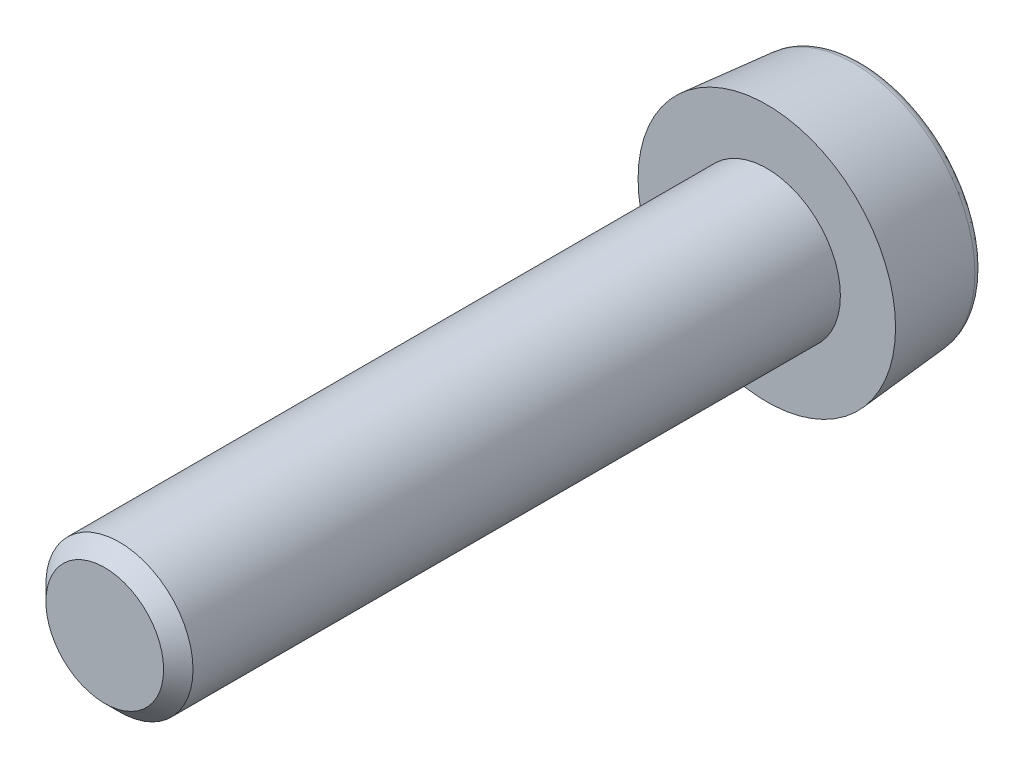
ISO-10303-21;
HEADER;
FILE_DESCRIPTION(('STEP AP214'),'2;1');
FILE_NAME('part.step','',(''),(''),'','','');
FILE_SCHEMA(('AUTOMOTIVE_DESIGN { 1 0 10303 214 1 1 1 1 }'));
ENDSEC;
DATA;
#1=APPLICATION_CONTEXT('core data for automotive mechanical design processes');
#2=APPLICATION_PROTOCOL_DEFINITION('international standard','automotive_design',2000,#1);
#3=PRODUCT_CONTEXT('',#1,'mechanical');
#4=PRODUCT('Part','Part','',(#3));
#5=PRODUCT_RELATED_PRODUCT_CATEGORY('part','',(#4));
#6=PRODUCT_DEFINITION_FORMATION('','',#4);
#7=PRODUCT_DEFINITION_CONTEXT('part definition',#1,'design');
#8=PRODUCT_DEFINITION('design','',#6,#7);
#9=PRODUCT_DEFINITION_SHAPE('','',#8);
#10=(LENGTH_UNIT() NAMED_UNIT(*) SI_UNIT(.MILLI.,.METRE.));
#11=(NAMED_UNIT(*) PLANE_ANGLE_UNIT() SI_UNIT($,.RADIAN.));
#12=(NAMED_UNIT(*) SI_UNIT($,.STERADIAN.) SOLID_ANGLE_UNIT());
#13=UNCERTAINTY_MEASURE_WITH_UNIT(LENGTH_MEASURE(1.E-05),#10,'distance_accuracy_value','');
#14=(GEOMETRIC_REPRESENTATION_CONTEXT(3) GLOBAL_UNCERTAINTY_ASSIGNED_CONTEXT((#13)) GLOBAL_UNIT_ASSIGNED_CONTEXT((#10,
#11,#12)) REPRESENTATION_CONTEXT('',''));
#15=CARTESIAN_POINT('',(0.,0.,0.));
#16=DIRECTION('',(0.,0.,1.));
#17=DIRECTION('',(1.,0.,0.));
#18=AXIS2_PLACEMENT_3D('',#15,#16,#17);
#19=CARTESIAN_POINT('',(0.,0.,-2.6));
#20=DIRECTION('',(0.,0.,1.));
#21=DIRECTION('',(1.,0.,0.));
#22=AXIS2_PLACEMENT_3D('',#19,#20,#21);
#23=PLANE('',#22);
#24=CARTESIAN_POINT('',(0.,0.,-2.6));
#25=DIRECTION('',(0.,0.,-1.));
#26=DIRECTION('',(-1.,0.,0.));
#27=AXIS2_PLACEMENT_3D('',#24,#25,#26);
#28=CIRCLE('',#27,3.03428336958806);
#29=CARTESIAN_POINT('',(-3.03428336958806,0.,-2.6));
#30=VERTEX_POINT('',#29);
#31=EDGE_CURVE('E221',#30,#30,#28,.T.);
#32=ORIENTED_EDGE('',*,*,#31,.T.);
#33=EDGE_LOOP('',(#32));
#34=FACE_BOUND('',#33,.T.);
#35=DIRECTION('',(0.,-1.,0.));
#36=VECTOR('',#35,1.);
#37=CARTESIAN_POINT('',(-0.499999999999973,-0.499999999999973,-2.6));
#38=LINE('',#37,#36);
#39=CARTESIAN_POINT('',(-0.499999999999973,-0.499999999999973,-2.6));
#40=VERTEX_POINT('',#39);
#41=CARTESIAN_POINT('',(-0.499999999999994,-2.,-2.6));
#42=VERTEX_POINT('',#41);
#43=EDGE_CURVE('E47',#40,#42,#38,.T.);
#44=ORIENTED_EDGE('',*,*,#43,.T.);
#45=DIRECTION('',(1.,0.,0.));
#46=VECTOR('',#45,1.);
#47=CARTESIAN_POINT('',(-0.499999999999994,-2.,-2.6));
#48=LINE('',#47,#46);
#49=CARTESIAN_POINT('',(0.49999999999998,-2.,-2.6));
#50=VERTEX_POINT('',#49);
#51=EDGE_CURVE('E123',#42,#50,#48,.T.);
#52=ORIENTED_EDGE('',*,*,#51,.T.);
#53=DIRECTION('',(0.,1.,0.));
#54=VECTOR('',#53,1.);
#55=CARTESIAN_POINT('',(0.499999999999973,-0.499999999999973,-2.6));
#56=LINE('',#55,#54);
#57=CARTESIAN_POINT('',(0.499999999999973,-0.499999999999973,-2.6));
#58=VERTEX_POINT('',#57);
#59=EDGE_CURVE('E131',#50,#58,#56,.T.);
#60=ORIENTED_EDGE('',*,*,#59,.T.);
#61=DIRECTION('',(1.,0.,0.));
#62=VECTOR('',#61,1.);
#63=CARTESIAN_POINT('',(0.499999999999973,-0.499999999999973,-2.6));
#64=LINE('',#63,#62);
#65=CARTESIAN_POINT('',(2.,-0.499999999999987,-2.6));
#66=VERTEX_POINT('',#65);
#67=EDGE_CURVE('E149',#58,#66,#64,.T.);
#68=ORIENTED_EDGE('',*,*,#67,.T.);
#69=DIRECTION('',(0.,1.,0.));
#70=VECTOR('',#69,1.);
#71=CARTESIAN_POINT('',(2.,0.499999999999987,-2.6));
#72=LINE('',#71,#70);
#73=CARTESIAN_POINT('',(2.,0.499999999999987,-2.6));
#74=VERTEX_POINT('',#73);
#75=EDGE_CURVE('E152',#66,#74,#72,.T.);
#76=ORIENTED_EDGE('',*,*,#75,.T.);
#77=DIRECTION('',(-1.,0.,0.));
#78=VECTOR('',#77,1.);
#79=CARTESIAN_POINT('',(0.499999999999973,0.499999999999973,-2.6));
#80=LINE('',#79,#78);
#81=CARTESIAN_POINT('',(0.499999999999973,0.499999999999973,-2.6));
#82=VERTEX_POINT('',#81);
#83=EDGE_CURVE('E155',#74,#82,#80,.T.);
#84=ORIENTED_EDGE('',*,*,#83,.T.);
#85=DIRECTION('',(0.,1.,0.));
#86=VECTOR('',#85,1.);
#87=CARTESIAN_POINT('',(0.499999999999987,2.,-2.6));
#88=LINE('',#87,#86);
#89=CARTESIAN_POINT('',(0.499999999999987,2.,-2.6));
#90=VERTEX_POINT('',#89);
#91=EDGE_CURVE('E158',#82,#90,#88,.T.);
#92=ORIENTED_EDGE('',*,*,#91,.T.);
#93=DIRECTION('',(-1.,0.,0.));
#94=VECTOR('',#93,1.);
#95=CARTESIAN_POINT('',(-0.499999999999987,2.,-2.6));
#96=LINE('',#95,#94);
#97=CARTESIAN_POINT('',(-0.499999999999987,2.,-2.6));
#98=VERTEX_POINT('',#97);
#99=EDGE_CURVE('E161',#90,#98,#96,.T.);
#100=ORIENTED_EDGE('',*,*,#99,.T.);
#101=DIRECTION('',(0.,-1.,0.));
#102=VECTOR('',#101,1.);
#103=CARTESIAN_POINT('',(-0.499999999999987,2.,-2.6));
#104=LINE('',#103,#102);
#105=CARTESIAN_POINT('',(-0.499999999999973,0.499999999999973,-2.6));
#106=VERTEX_POINT('',#105);
#107=EDGE_CURVE('E164',#98,#106,#104,.T.);
#108=ORIENTED_EDGE('',*,*,#107,.T.);
#109=DIRECTION('',(-1.,0.,0.));
#110=VECTOR('',#109,1.);
#111=CARTESIAN_POINT('',(-2.,0.499999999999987,-2.6));
#112=LINE('',#111,#110);
#113=CARTESIAN_POINT('',(-2.,0.499999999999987,-2.6));
#114=VERTEX_POINT('',#113);
#115=EDGE_CURVE('E167',#106,#114,#112,.T.);
#116=ORIENTED_EDGE('',*,*,#115,.T.);
#117=DIRECTION('',(0.,-1.,0.));
#118=VECTOR('',#117,1.);
#119=CARTESIAN_POINT('',(-2.,0.499999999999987,-2.6));
#120=LINE('',#119,#118);
#121=CARTESIAN_POINT('',(-2.,-0.499999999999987,-2.6));
#122=VERTEX_POINT('',#121);
#123=EDGE_CURVE('E170',#114,#122,#120,.T.);
#124=ORIENTED_EDGE('',*,*,#123,.T.);
#125=DIRECTION('',(1.,0.,0.));
#126=VECTOR('',#125,1.);
#127=CARTESIAN_POINT('',(-2.,-0.499999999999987,-2.6));
#128=LINE('',#127,#126);
#129=EDGE_CURVE('E142',#122,#40,#128,.T.);
#130=ORIENTED_EDGE('',*,*,#129,.T.);
#131=EDGE_LOOP('',(#44,#52,#60,#68,#76,#84,#92,#100,#108,#116,#124,#130));
#132=FACE_BOUND('',#131,.T.);
#133=ADVANCED_FACE('F33',(#34,#132),#23,.F.);
#134=CARTESIAN_POINT('',(0.,0.,-2.33999999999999));
#135=DIRECTION('',(0.,0.,-1.));
#136=DIRECTION('',(-1.,0.,0.));
#137=AXIS2_PLACEMENT_3D('',#134,#135,#136);
#138=TOROIDAL_SURFACE('',#137,3.03428336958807,0.26);
#139=ORIENTED_EDGE('',*,*,#31,.F.);
#140=EDGE_LOOP('',(#139));
#141=FACE_BOUND('',#140,.T.);
#142=CARTESIAN_POINT('',(0.,0.,-2.36266049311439));
#143=DIRECTION('',(0.,0.,-1.));
#144=DIRECTION('',(-1.,0.,0.));
#145=AXIS2_PLACEMENT_3D('',#142,#143,#144);
#146=CIRCLE('',#145,3.29329399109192);
#147=CARTESIAN_POINT('',(-3.29329399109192,0.,-2.36266049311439));
#148=VERTEX_POINT('',#147);
#149=EDGE_CURVE('E218',#148,#148,#146,.T.);
#150=ORIENTED_EDGE('',*,*,#149,.T.);
#151=EDGE_LOOP('',(#150));
#152=FACE_BOUND('',#151,.T.);
#153=ADVANCED_FACE('F240',(#141,#152),#138,.T.);
#154=CARTESIAN_POINT('',(0.,0.,0.));
#155=DIRECTION('',(0.,0.,1.));
#156=DIRECTION('',(1.,0.,0.));
#157=AXIS2_PLACEMENT_3D('',#154,#155,#156);
#158=CONICAL_SURFACE('',#157,3.5,0.0872664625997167);
#159=ORIENTED_EDGE('',*,*,#149,.F.);
#160=EDGE_LOOP('',(#159));
#161=FACE_BOUND('',#160,.T.);
#162=CARTESIAN_POINT('',(0.,0.,0.));
#163=DIRECTION('',(0.,0.,-1.));
#164=DIRECTION('',(-1.,0.,0.));
#165=AXIS2_PLACEMENT_3D('',#162,#163,#164);
#166=CIRCLE('',#165,3.5);
#167=CARTESIAN_POINT('',(-3.5,0.,0.));
#168=VERTEX_POINT('',#167);
#169=EDGE_CURVE('E137',#168,#168,#166,.T.);
#170=ORIENTED_EDGE('',*,*,#169,.T.);
#171=EDGE_LOOP('',(#170));
#172=FACE_BOUND('',#171,.T.);
#173=ADVANCED_FACE('F245',(#161,#172),#158,.T.);
#174=CARTESIAN_POINT('',(0.,0.,0.));
#175=DIRECTION('',(0.,0.,-1.));
#176=DIRECTION('',(-1.,0.,0.));
#177=AXIS2_PLACEMENT_3D('',#174,#175,#176);
#178=PLANE('',#177);
#179=CARTESIAN_POINT('',(0.,0.,0.));
#180=DIRECTION('',(0.,0.,1.));
#181=DIRECTION('',(1.,0.,0.));
#182=AXIS2_PLACEMENT_3D('',#179,#180,#181);
#183=CIRCLE('',#182,2.);
#184=CARTESIAN_POINT('',(2.,0.,0.));
#185=VERTEX_POINT('',#184);
#186=EDGE_CURVE('E143',#185,#185,#183,.T.);
#187=ORIENTED_EDGE('',*,*,#186,.F.);
#188=EDGE_LOOP('',(#187));
#189=FACE_BOUND('',#188,.T.);
#190=ORIENTED_EDGE('',*,*,#169,.F.);
#191=EDGE_LOOP('',(#190));
#192=FACE_BOUND('',#191,.T.);
#193=ADVANCED_FACE('F253',(#189,#192),#178,.F.);
#194=CARTESIAN_POINT('',(-0.499999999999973,-0.499999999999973,-1.));
#195=DIRECTION('',(1.,0.,0.));
#196=DIRECTION('',(0.,1.,0.));
#197=AXIS2_PLACEMENT_3D('',#194,#195,#196);
#198=PLANE('',#197);
#199=ORIENTED_EDGE('',*,*,#43,.F.);
#200=DIRECTION('',(0.,0.,-1.));
#201=VECTOR('',#200,1.);
#202=CARTESIAN_POINT('',(-0.499999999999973,-0.499999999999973,-1.));
#203=LINE('',#202,#201);
#204=CARTESIAN_POINT('',(-0.499999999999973,-0.499999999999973,-1.));
#205=VERTEX_POINT('',#204);
#206=EDGE_CURVE('E195',#205,#40,#203,.T.);
#207=ORIENTED_EDGE('',*,*,#206,.F.);
#208=DIRECTION('',(0.,-1.,0.));
#209=VECTOR('',#208,1.);
#210=CARTESIAN_POINT('',(-0.499999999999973,-0.499999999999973,-1.));
#211=LINE('',#210,#209);
#212=CARTESIAN_POINT('',(-0.499999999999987,-2.,-1.));
#213=VERTEX_POINT('',#212);
#214=EDGE_CURVE('E136',#205,#213,#211,.T.);
#215=ORIENTED_EDGE('',*,*,#214,.T.);
#216=DIRECTION('',(0.,0.,-1.));
#217=VECTOR('',#216,1.);
#218=CARTESIAN_POINT('',(-0.499999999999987,-2.,-1.));
#219=LINE('',#218,#217);
#220=EDGE_CURVE('E125',#213,#42,#219,.T.);
#221=ORIENTED_EDGE('',*,*,#220,.T.);
#222=EDGE_LOOP('',(#199,#207,#215,#221));
#223=FACE_BOUND('',#222,.T.);
#224=ADVANCED_FACE('F134',(#223),#198,.T.);
#225=CARTESIAN_POINT('',(-0.499999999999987,-2.,-1.));
#226=DIRECTION('',(0.,1.,0.));
#227=DIRECTION('',(-1.,0.,0.));
#228=AXIS2_PLACEMENT_3D('',#225,#226,#227);
#229=PLANE('',#228);
#230=ORIENTED_EDGE('',*,*,#51,.F.);
#231=ORIENTED_EDGE('',*,*,#220,.F.);
#232=DIRECTION('',(1.,0.,0.));
#233=VECTOR('',#232,1.);
#234=CARTESIAN_POINT('',(-0.499999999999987,-2.,-1.));
#235=LINE('',#234,#233);
#236=CARTESIAN_POINT('',(0.499999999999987,-2.,-1.));
#237=VERTEX_POINT('',#236);
#238=EDGE_CURVE('E174',#213,#237,#235,.T.);
#239=ORIENTED_EDGE('',*,*,#238,.T.);
#240=DIRECTION('',(0.,0.,-1.));
#241=VECTOR('',#240,1.);
#242=CARTESIAN_POINT('',(0.499999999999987,-2.,-1.));
#243=LINE('',#242,#241);
#244=EDGE_CURVE('E127',#237,#50,#243,.T.);
#245=ORIENTED_EDGE('',*,*,#244,.T.);
#246=EDGE_LOOP('',(#230,#231,#239,#245));
#247=FACE_BOUND('',#246,.T.);
#248=ADVANCED_FACE('F124',(#247),#229,.T.);
#249=CARTESIAN_POINT('',(0.499999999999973,-0.499999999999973,-1.));
#250=DIRECTION('',(-1.,0.,0.));
#251=DIRECTION('',(0.,-1.,0.));
#252=AXIS2_PLACEMENT_3D('',#249,#250,#251);
#253=PLANE('',#252);
#254=ORIENTED_EDGE('',*,*,#59,.F.);
#255=ORIENTED_EDGE('',*,*,#244,.F.);
#256=DIRECTION('',(0.,1.,0.));
#257=VECTOR('',#256,1.);
#258=CARTESIAN_POINT('',(0.499999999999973,-0.499999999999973,-1.));
#259=LINE('',#258,#257);
#260=CARTESIAN_POINT('',(0.499999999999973,-0.499999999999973,-1.));
#261=VERTEX_POINT('',#260);
#262=EDGE_CURVE('E176',#237,#261,#259,.T.);
#263=ORIENTED_EDGE('',*,*,#262,.T.);
#264=DIRECTION('',(0.,0.,-1.));
#265=VECTOR('',#264,1.);
#266=CARTESIAN_POINT('',(0.499999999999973,-0.499999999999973,-1.));
#267=LINE('',#266,#265);
#268=EDGE_CURVE('E213',#261,#58,#267,.T.);
#269=ORIENTED_EDGE('',*,*,#268,.T.);
#270=EDGE_LOOP('',(#254,#255,#263,#269));
#271=FACE_BOUND('',#270,.T.);
#272=ADVANCED_FACE('F268',(#271),#253,.T.);
#273=CARTESIAN_POINT('',(0.499999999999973,-0.499999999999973,-1.));
#274=DIRECTION('',(0.,1.,0.));
#275=DIRECTION('',(-1.,0.,0.));
#276=AXIS2_PLACEMENT_3D('',#273,#274,#275);
#277=PLANE('',#276);
#278=ORIENTED_EDGE('',*,*,#67,.F.);
#279=ORIENTED_EDGE('',*,*,#268,.F.);
#280=DIRECTION('',(1.,0.,0.));
#281=VECTOR('',#280,1.);
#282=CARTESIAN_POINT('',(0.499999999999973,-0.499999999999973,-1.));
#283=LINE('',#282,#281);
#284=CARTESIAN_POINT('',(2.,-0.499999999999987,-1.));
#285=VERTEX_POINT('',#284);
#286=EDGE_CURVE('E178',#261,#285,#283,.T.);
#287=ORIENTED_EDGE('',*,*,#286,.T.);
#288=DIRECTION('',(0.,0.,-1.));
#289=VECTOR('',#288,1.);
#290=CARTESIAN_POINT('',(2.,-0.499999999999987,-1.));
#291=LINE('',#290,#289);
#292=EDGE_CURVE('E211',#285,#66,#291,.T.);
#293=ORIENTED_EDGE('',*,*,#292,.T.);
#294=EDGE_LOOP('',(#278,#279,#287,#293));
#295=FACE_BOUND('',#294,.T.);
#296=ADVANCED_FACE('F271',(#295),#277,.T.);
#297=CARTESIAN_POINT('',(2.,0.499999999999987,-1.));
#298=DIRECTION('',(-1.,0.,0.));
#299=DIRECTION('',(0.,0.,1.));
#300=AXIS2_PLACEMENT_3D('',#297,#298,#299);
#301=PLANE('',#300);
#302=ORIENTED_EDGE('',*,*,#75,.F.);
#303=ORIENTED_EDGE('',*,*,#292,.F.);
#304=DIRECTION('',(0.,1.,0.));
#305=VECTOR('',#304,1.);
#306=CARTESIAN_POINT('',(2.,0.499999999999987,-1.));
#307=LINE('',#306,#305);
#308=CARTESIAN_POINT('',(2.,0.499999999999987,-1.));
#309=VERTEX_POINT('',#308);
#310=EDGE_CURVE('E180',#285,#309,#307,.T.);
#311=ORIENTED_EDGE('',*,*,#310,.T.);
#312=DIRECTION('',(0.,0.,-1.));
#313=VECTOR('',#312,1.);
#314=CARTESIAN_POINT('',(2.,0.499999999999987,-1.));
#315=LINE('',#314,#313);
#316=EDGE_CURVE('E209',#309,#74,#315,.T.);
#317=ORIENTED_EDGE('',*,*,#316,.T.);
#318=EDGE_LOOP('',(#302,#303,#311,#317));
#319=FACE_BOUND('',#318,.T.);
#320=ADVANCED_FACE('F275',(#319),#301,.T.);
#321=CARTESIAN_POINT('',(0.499999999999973,0.499999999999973,-1.));
#322=DIRECTION('',(0.,-1.,0.));
#323=DIRECTION('',(1.,0.,0.));
#324=AXIS2_PLACEMENT_3D('',#321,#322,#323);
#325=PLANE('',#324);
#326=ORIENTED_EDGE('',*,*,#83,.F.);
#327=ORIENTED_EDGE('',*,*,#316,.F.);
#328=DIRECTION('',(-1.,0.,0.));
#329=VECTOR('',#328,1.);
#330=CARTESIAN_POINT('',(0.499999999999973,0.499999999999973,-1.));
#331=LINE('',#330,#329);
#332=CARTESIAN_POINT('',(0.499999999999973,0.499999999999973,-1.));
#333=VERTEX_POINT('',#332);
#334=EDGE_CURVE('E182',#309,#333,#331,.T.);
#335=ORIENTED_EDGE('',*,*,#334,.T.);
#336=DIRECTION('',(0.,0.,-1.));
#337=VECTOR('',#336,1.);
#338=CARTESIAN_POINT('',(0.499999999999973,0.499999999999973,-1.));
#339=LINE('',#338,#337);
#340=EDGE_CURVE('E207',#333,#82,#339,.T.);
#341=ORIENTED_EDGE('',*,*,#340,.T.);
#342=EDGE_LOOP('',(#326,#327,#335,#341));
#343=FACE_BOUND('',#342,.T.);
#344=ADVANCED_FACE('F279',(#343),#325,.T.);
#345=CARTESIAN_POINT('',(0.499999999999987,2.,-1.));
#346=DIRECTION('',(-1.,0.,0.));
#347=DIRECTION('',(0.,-1.,0.));
#348=AXIS2_PLACEMENT_3D('',#345,#346,#347);
#349=PLANE('',#348);
#350=ORIENTED_EDGE('',*,*,#91,.F.);
#351=ORIENTED_EDGE('',*,*,#340,.F.);
#352=DIRECTION('',(0.,1.,0.));
#353=VECTOR('',#352,1.);
#354=CARTESIAN_POINT('',(0.499999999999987,2.,-1.));
#355=LINE('',#354,#353);
#356=CARTESIAN_POINT('',(0.499999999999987,2.,-1.));
#357=VERTEX_POINT('',#356);
#358=EDGE_CURVE('E184',#333,#357,#355,.T.);
#359=ORIENTED_EDGE('',*,*,#358,.T.);
#360=DIRECTION('',(0.,0.,-1.));
#361=VECTOR('',#360,1.);
#362=CARTESIAN_POINT('',(0.499999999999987,2.,-1.));
#363=LINE('',#362,#361);
#364=EDGE_CURVE('E205',#357,#90,#363,.T.);
#365=ORIENTED_EDGE('',*,*,#364,.T.);
#366=EDGE_LOOP('',(#350,#351,#359,#365));
#367=FACE_BOUND('',#366,.T.);
#368=ADVANCED_FACE('F283',(#367),#349,.T.);
#369=CARTESIAN_POINT('',(-0.499999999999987,2.,-1.));
#370=DIRECTION('',(0.,-1.,0.));
#371=DIRECTION('',(1.,0.,0.));
#372=AXIS2_PLACEMENT_3D('',#369,#370,#371);
#373=PLANE('',#372);
#374=ORIENTED_EDGE('',*,*,#99,.F.);
#375=ORIENTED_EDGE('',*,*,#364,.F.);
#376=DIRECTION('',(-1.,0.,0.));
#377=VECTOR('',#376,1.);
#378=CARTESIAN_POINT('',(-0.499999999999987,2.,-1.));
#379=LINE('',#378,#377);
#380=CARTESIAN_POINT('',(-0.499999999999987,2.,-1.));
#381=VERTEX_POINT('',#380);
#382=EDGE_CURVE('E186',#357,#381,#379,.T.);
#383=ORIENTED_EDGE('',*,*,#382,.T.);
#384=DIRECTION('',(0.,0.,-1.));
#385=VECTOR('',#384,1.);
#386=CARTESIAN_POINT('',(-0.499999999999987,2.,-1.));
#387=LINE('',#386,#385);
#388=EDGE_CURVE('E203',#381,#98,#387,.T.);
#389=ORIENTED_EDGE('',*,*,#388,.T.);
#390=EDGE_LOOP('',(#374,#375,#383,#389));
#391=FACE_BOUND('',#390,.T.);
#392=ADVANCED_FACE('F287',(#391),#373,.T.);
#393=CARTESIAN_POINT('',(-0.499999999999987,2.,-1.));
#394=DIRECTION('',(1.,0.,0.));
#395=DIRECTION('',(0.,1.,0.));
#396=AXIS2_PLACEMENT_3D('',#393,#394,#395);
#397=PLANE('',#396);
#398=ORIENTED_EDGE('',*,*,#107,.F.);
#399=ORIENTED_EDGE('',*,*,#388,.F.);
#400=DIRECTION('',(0.,-1.,0.));
#401=VECTOR('',#400,1.);
#402=CARTESIAN_POINT('',(-0.499999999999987,2.,-1.));
#403=LINE('',#402,#401);
#404=CARTESIAN_POINT('',(-0.499999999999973,0.499999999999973,-1.));
#405=VERTEX_POINT('',#404);
#406=EDGE_CURVE('E188',#381,#405,#403,.T.);
#407=ORIENTED_EDGE('',*,*,#406,.T.);
#408=DIRECTION('',(0.,0.,-1.));
#409=VECTOR('',#408,1.);
#410=CARTESIAN_POINT('',(-0.499999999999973,0.499999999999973,-1.));
#411=LINE('',#410,#409);
#412=EDGE_CURVE('E201',#405,#106,#411,.T.);
#413=ORIENTED_EDGE('',*,*,#412,.T.);
#414=EDGE_LOOP('',(#398,#399,#407,#413));
#415=FACE_BOUND('',#414,.T.);
#416=ADVANCED_FACE('F291',(#415),#397,.T.);
#417=CARTESIAN_POINT('',(-2.,0.499999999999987,-1.));
#418=DIRECTION('',(0.,-1.,0.));
#419=DIRECTION('',(1.,0.,0.));
#420=AXIS2_PLACEMENT_3D('',#417,#418,#419);
#421=PLANE('',#420);
#422=ORIENTED_EDGE('',*,*,#115,.F.);
#423=ORIENTED_EDGE('',*,*,#412,.F.);
#424=DIRECTION('',(-1.,0.,0.));
#425=VECTOR('',#424,1.);
#426=CARTESIAN_POINT('',(-2.,0.499999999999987,-1.));
#427=LINE('',#426,#425);
#428=CARTESIAN_POINT('',(-2.,0.499999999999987,-1.));
#429=VERTEX_POINT('',#428);
#430=EDGE_CURVE('E190',#405,#429,#427,.T.);
#431=ORIENTED_EDGE('',*,*,#430,.T.);
#432=DIRECTION('',(0.,0.,-1.));
#433=VECTOR('',#432,1.);
#434=CARTESIAN_POINT('',(-2.,0.499999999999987,-1.));
#435=LINE('',#434,#433);
#436=EDGE_CURVE('E199',#429,#114,#435,.T.);
#437=ORIENTED_EDGE('',*,*,#436,.T.);
#438=EDGE_LOOP('',(#422,#423,#431,#437));
#439=FACE_BOUND('',#438,.T.);
#440=ADVANCED_FACE('F295',(#439),#421,.T.);
#441=CARTESIAN_POINT('',(-2.,0.499999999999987,-1.));
#442=DIRECTION('',(1.,0.,0.));
#443=DIRECTION('',(0.,0.,-1.));
#444=AXIS2_PLACEMENT_3D('',#441,#442,#443);
#445=PLANE('',#444);
#446=ORIENTED_EDGE('',*,*,#123,.F.);
#447=ORIENTED_EDGE('',*,*,#436,.F.);
#448=DIRECTION('',(0.,-1.,0.));
#449=VECTOR('',#448,1.);
#450=CARTESIAN_POINT('',(-2.,0.499999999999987,-1.));
#451=LINE('',#450,#449);
#452=CARTESIAN_POINT('',(-2.,-0.499999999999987,-1.));
#453=VERTEX_POINT('',#452);
#454=EDGE_CURVE('E192',#429,#453,#451,.T.);
#455=ORIENTED_EDGE('',*,*,#454,.T.);
#456=DIRECTION('',(0.,0.,-1.));
#457=VECTOR('',#456,1.);
#458=CARTESIAN_POINT('',(-2.,-0.499999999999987,-1.));
#459=LINE('',#458,#457);
#460=EDGE_CURVE('E197',#453,#122,#459,.T.);
#461=ORIENTED_EDGE('',*,*,#460,.T.);
#462=EDGE_LOOP('',(#446,#447,#455,#461));
#463=FACE_BOUND('',#462,.T.);
#464=ADVANCED_FACE('F299',(#463),#445,.T.);
#465=CARTESIAN_POINT('',(-2.,-0.499999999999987,-1.));
#466=DIRECTION('',(0.,1.,0.));
#467=DIRECTION('',(-1.,0.,0.));
#468=AXIS2_PLACEMENT_3D('',#465,#466,#467);
#469=PLANE('',#468);
#470=ORIENTED_EDGE('',*,*,#129,.F.);
#471=ORIENTED_EDGE('',*,*,#460,.F.);
#472=DIRECTION('',(1.,0.,0.));
#473=VECTOR('',#472,1.);
#474=CARTESIAN_POINT('',(-2.,-0.499999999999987,-1.));
#475=LINE('',#474,#473);
#476=EDGE_CURVE('E54',#453,#205,#475,.T.);
#477=ORIENTED_EDGE('',*,*,#476,.T.);
#478=ORIENTED_EDGE('',*,*,#206,.T.);
#479=EDGE_LOOP('',(#470,#471,#477,#478));
#480=FACE_BOUND('',#479,.T.);
#481=ADVANCED_FACE('F303',(#480),#469,.T.);
#482=CARTESIAN_POINT('',(-0.499999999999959,0.499999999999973,-1.));
#483=DIRECTION('',(0.,0.,1.));
#484=DIRECTION('',(1.,0.,0.));
#485=AXIS2_PLACEMENT_3D('',#482,#483,#484);
#486=PLANE('',#485);
#487=ORIENTED_EDGE('',*,*,#214,.F.);
#488=ORIENTED_EDGE('',*,*,#476,.F.);
#489=ORIENTED_EDGE('',*,*,#454,.F.);
#490=ORIENTED_EDGE('',*,*,#430,.F.);
#491=ORIENTED_EDGE('',*,*,#406,.F.);
#492=ORIENTED_EDGE('',*,*,#382,.F.);
#493=ORIENTED_EDGE('',*,*,#358,.F.);
#494=ORIENTED_EDGE('',*,*,#334,.F.);
#495=ORIENTED_EDGE('',*,*,#310,.F.);
#496=ORIENTED_EDGE('',*,*,#286,.F.);
#497=ORIENTED_EDGE('',*,*,#262,.F.);
#498=ORIENTED_EDGE('',*,*,#238,.F.);
#499=EDGE_LOOP('',(#487,#488,#489,#490,#491,#492,#493,#494,#495,#496,#497,#498));
#500=FACE_BOUND('',#499,.T.);
#501=ADVANCED_FACE('F307',(#500),#486,.F.);
#502=CARTESIAN_POINT('',(0.,0.,18.));
#503=DIRECTION('',(0.,0.,1.));
#504=DIRECTION('',(1.,0.,0.));
#505=AXIS2_PLACEMENT_3D('',#502,#503,#504);
#506=PLANE('',#505);
#507=CARTESIAN_POINT('',(0.,0.,18.));
#508=DIRECTION('',(0.,0.,1.));
#509=DIRECTION('',(1.,0.,0.));
#510=AXIS2_PLACEMENT_3D('',#507,#508,#509);
#511=CIRCLE('',#510,1.59999999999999);
#512=CARTESIAN_POINT('',(1.59999999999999,0.,18.));
#513=VERTEX_POINT('',#512);
#514=EDGE_CURVE('E40',#513,#513,#511,.T.);
#515=ORIENTED_EDGE('',*,*,#514,.T.);
#516=EDGE_LOOP('',(#515));
#517=FACE_BOUND('',#516,.T.);
#518=ADVANCED_FACE('F226',(#517),#506,.T.);
#519=CARTESIAN_POINT('',(0.,0.,0.));
#520=DIRECTION('',(0.,0.,1.));
#521=DIRECTION('',(1.,0.,0.));
#522=AXIS2_PLACEMENT_3D('',#519,#520,#521);
#523=CYLINDRICAL_SURFACE('',#522,2.);
#524=CARTESIAN_POINT('',(0.,0.,17.6));
#525=DIRECTION('',(0.,0.,1.));
#526=DIRECTION('',(1.,0.,0.));
#527=AXIS2_PLACEMENT_3D('',#524,#525,#526);
#528=CIRCLE('',#527,2.);
#529=CARTESIAN_POINT('',(2.,0.,17.6));
#530=VERTEX_POINT('',#529);
#531=EDGE_CURVE('E11',#530,#530,#528,.F.);
#532=ORIENTED_EDGE('',*,*,#531,.T.);
#533=EDGE_LOOP('',(#532));
#534=FACE_BOUND('',#533,.T.);
#535=ORIENTED_EDGE('',*,*,#186,.T.);
#536=EDGE_LOOP('',(#535));
#537=FACE_BOUND('',#536,.T.);
#538=ADVANCED_FACE('F230',(#534,#537),#523,.T.);
#539=CARTESIAN_POINT('',(0.,0.,18.));
#540=DIRECTION('',(0.,0.,-1.));
#541=DIRECTION('',(-1.,0.,0.));
#542=AXIS2_PLACEMENT_3D('',#539,#540,#541);
#543=CONICAL_SURFACE('',#542,1.59999999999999,0.785398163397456);
#544=ORIENTED_EDGE('',*,*,#531,.F.);
#545=EDGE_LOOP('',(#544));
#546=FACE_BOUND('',#545,.T.);
#547=ORIENTED_EDGE('',*,*,#514,.F.);
#548=EDGE_LOOP('',(#547));
#549=FACE_BOUND('',#548,.T.);
#550=ADVANCED_FACE('F228',(#546,#549),#543,.T.);
#551=CLOSED_SHELL('',(#133,#153,#173,#193,#224,#248,#272,#296,#320,#344,#368,#392,#416,#440,
#464,#481,#501,#518,#538,#550));
#552=MANIFOLD_SOLID_BREP('B2',#551);
#553=ADVANCED_BREP_SHAPE_REPRESENTATION('',(#18,#552),#14);
#554=SHAPE_DEFINITION_REPRESENTATION(#9,#553);
ENDSEC;
END-ISO-10303-21;
